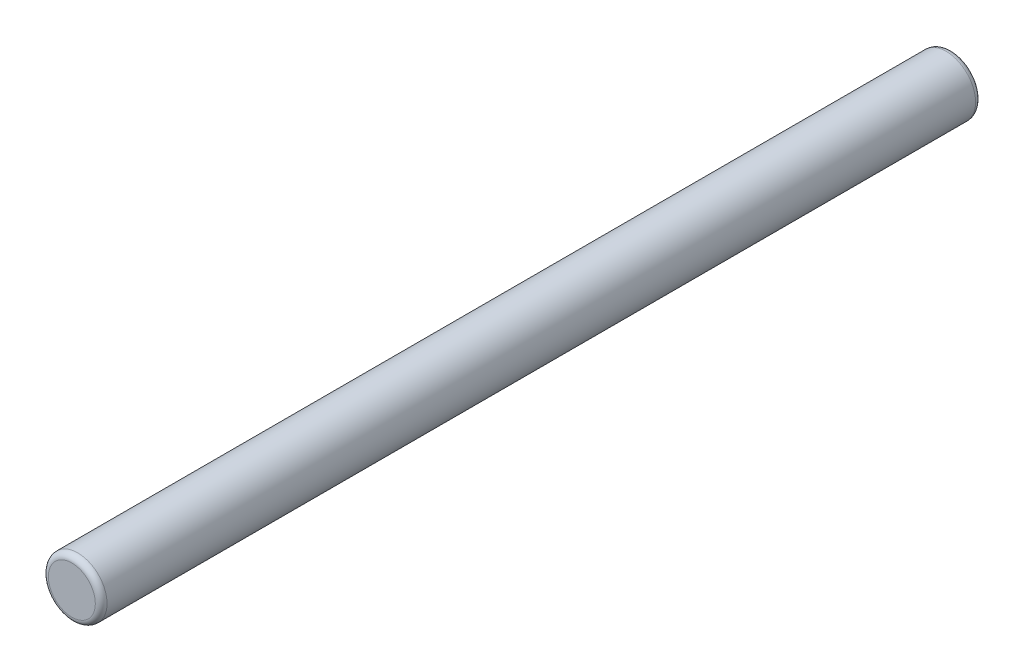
from build123d import *

# Parameters (mm, degrees)
ESQUISSE1_R      = 1
EXTRUSION1_DEPTH = 30
CONG_1_R         = 0.2


with BuildPart() as part:
    # Esquisse1 → Extrusion1 (new body)
    with BuildSketch(Plane.XY):
        Circle(ESQUISSE1_R)
    extrude(amount=EXTRUSION1_DEPTH)

    # Cong_1
    cong_1_edges = [part.edges().sort_by_distance(p)[0] for p in [
        (-1, 0, 0),
        (-1, 0, 30),
    ]]
    fillet(cong_1_edges, radius=CONG_1_R)


solid = part.part
